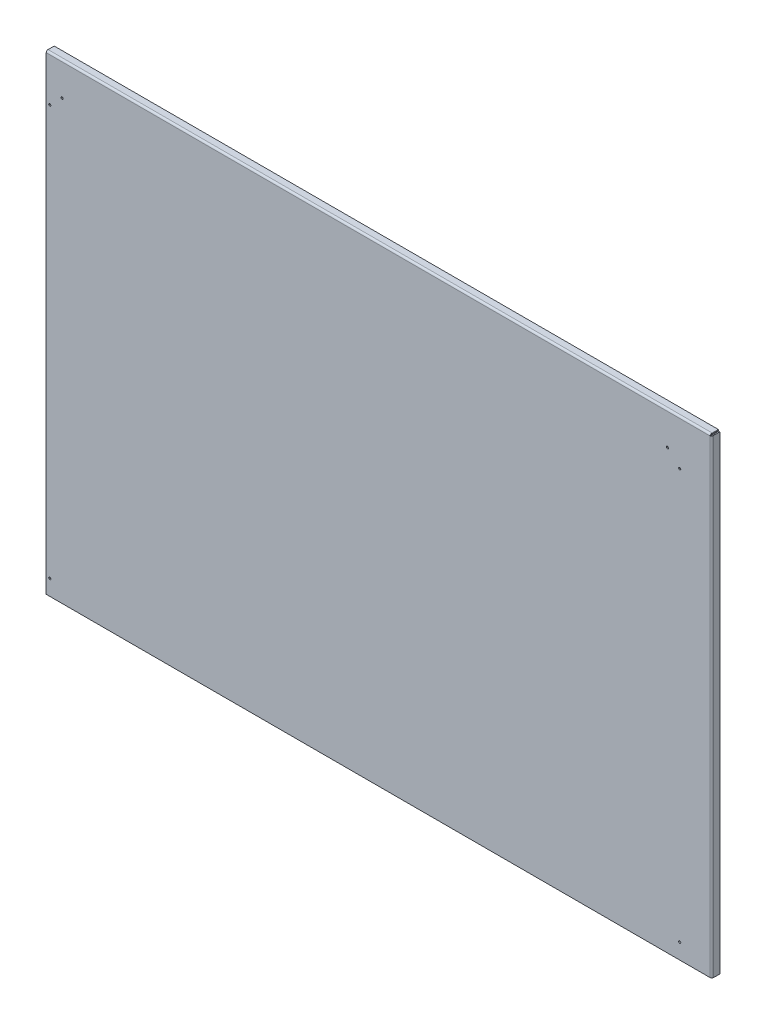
ISO-10303-21;
HEADER;
FILE_DESCRIPTION(('STEP AP214'),'2;1');
FILE_NAME('part.step','',(''),(''),'','','');
FILE_SCHEMA(('AUTOMOTIVE_DESIGN { 1 0 10303 214 1 1 1 1 }'));
ENDSEC;
DATA;
#1=APPLICATION_CONTEXT('core data for automotive mechanical design processes');
#2=APPLICATION_PROTOCOL_DEFINITION('international standard','automotive_design',2000,#1);
#3=PRODUCT_CONTEXT('',#1,'mechanical');
#4=PRODUCT('Part','Part','',(#3));
#5=PRODUCT_RELATED_PRODUCT_CATEGORY('part','',(#4));
#6=PRODUCT_DEFINITION_FORMATION('','',#4);
#7=PRODUCT_DEFINITION_CONTEXT('part definition',#1,'design');
#8=PRODUCT_DEFINITION('design','',#6,#7);
#9=PRODUCT_DEFINITION_SHAPE('','',#8);
#10=(LENGTH_UNIT() NAMED_UNIT(*) SI_UNIT(.MILLI.,.METRE.));
#11=(NAMED_UNIT(*) PLANE_ANGLE_UNIT() SI_UNIT($,.RADIAN.));
#12=(NAMED_UNIT(*) SI_UNIT($,.STERADIAN.) SOLID_ANGLE_UNIT());
#13=UNCERTAINTY_MEASURE_WITH_UNIT(LENGTH_MEASURE(1.E-05),#10,'distance_accuracy_value','');
#14=(GEOMETRIC_REPRESENTATION_CONTEXT(3) GLOBAL_UNCERTAINTY_ASSIGNED_CONTEXT((#13)) GLOBAL_UNIT_ASSIGNED_CONTEXT((#10,
#11,#12)) REPRESENTATION_CONTEXT('',''));
#15=CARTESIAN_POINT('',(0.,0.,0.));
#16=DIRECTION('',(0.,0.,1.));
#17=DIRECTION('',(1.,0.,0.));
#18=AXIS2_PLACEMENT_3D('',#15,#16,#17);
#19=CARTESIAN_POINT('',(0.,0.,-1.5));
#20=DIRECTION('',(0.,0.,-1.));
#21=DIRECTION('',(-1.,0.,0.));
#22=AXIS2_PLACEMENT_3D('',#19,#20,#21);
#23=PLANE('',#22);
#24=DIRECTION('',(0.,-1.,0.));
#25=VECTOR('',#24,1.);
#26=CARTESIAN_POINT('',(-440.1,0.,-1.5));
#27=LINE('',#26,#25);
#28=CARTESIAN_POINT('',(-440.1,322.8,-1.50000000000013));
#29=VERTEX_POINT('',#28);
#30=CARTESIAN_POINT('',(-440.1,-325.3,-1.50000000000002));
#31=VERTEX_POINT('',#30);
#32=EDGE_CURVE('E296',#29,#31,#27,.T.);
#33=ORIENTED_EDGE('',*,*,#32,.F.);
#34=DIRECTION('',(1.,0.,0.));
#35=VECTOR('',#34,1.);
#36=CARTESIAN_POINT('',(477.646446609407,322.8,-1.49999999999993));
#37=LINE('',#36,#35);
#38=CARTESIAN_POINT('',(477.,322.8,-1.5));
#39=VERTEX_POINT('',#38);
#40=EDGE_CURVE('E238',#39,#29,#37,.F.);
#41=ORIENTED_EDGE('',*,*,#40,.F.);
#42=DIRECTION('',(0.,-1.,0.));
#43=VECTOR('',#42,1.);
#44=CARTESIAN_POINT('',(477.,-325.3,-1.50000000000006));
#45=LINE('',#44,#43);
#46=CARTESIAN_POINT('',(477.,-325.3,-1.5));
#47=VERTEX_POINT('',#46);
#48=EDGE_CURVE('E384',#47,#39,#45,.F.);
#49=ORIENTED_EDGE('',*,*,#48,.F.);
#50=DIRECTION('',(1.,0.,0.));
#51=VECTOR('',#50,1.);
#52=CARTESIAN_POINT('',(479.5,-325.3,-1.5));
#53=LINE('',#52,#51);
#54=EDGE_CURVE('E13',#31,#47,#53,.T.);
#55=ORIENTED_EDGE('',*,*,#54,.F.);
#56=EDGE_LOOP('',(#33,#41,#49,#55));
#57=FACE_BOUND('',#56,.T.);
#58=CARTESIAN_POINT('',(435.15,262.7,-1.5));
#59=DIRECTION('',(0.,0.,1.));
#60=DIRECTION('',(1.,0.,0.));
#61=AXIS2_PLACEMENT_3D('',#58,#59,#60);
#62=CIRCLE('',#61,1.50000000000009);
#63=CARTESIAN_POINT('',(436.65,262.7,-1.5));
#64=VERTEX_POINT('',#63);
#65=EDGE_CURVE('E300',#64,#64,#62,.T.);
#66=ORIENTED_EDGE('',*,*,#65,.T.);
#67=EDGE_LOOP('',(#66));
#68=FACE_BOUND('',#67,.T.);
#69=CARTESIAN_POINT('',(418.1,279.45,-1.5));
#70=DIRECTION('',(0.,0.,1.));
#71=DIRECTION('',(1.,0.,0.));
#72=AXIS2_PLACEMENT_3D('',#69,#70,#71);
#73=CIRCLE('',#72,1.50000000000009);
#74=CARTESIAN_POINT('',(419.6,279.45,-1.5));
#75=VERTEX_POINT('',#74);
#76=EDGE_CURVE('E304',#75,#75,#73,.T.);
#77=ORIENTED_EDGE('',*,*,#76,.T.);
#78=EDGE_LOOP('',(#77));
#79=FACE_BOUND('',#78,.T.);
#80=CARTESIAN_POINT('',(-435.15,-303.8,-1.5));
#81=DIRECTION('',(0.,0.,1.));
#82=DIRECTION('',(-1.,0.,0.));
#83=AXIS2_PLACEMENT_3D('',#80,#81,#82);
#84=CIRCLE('',#83,1.50000000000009);
#85=CARTESIAN_POINT('',(-436.65,-303.8,-1.5));
#86=VERTEX_POINT('',#85);
#87=EDGE_CURVE('E308',#86,#86,#84,.T.);
#88=ORIENTED_EDGE('',*,*,#87,.T.);
#89=EDGE_LOOP('',(#88));
#90=FACE_BOUND('',#89,.T.);
#91=CARTESIAN_POINT('',(-435.15,262.7,-1.5));
#92=DIRECTION('',(0.,0.,1.));
#93=DIRECTION('',(-1.,0.,0.));
#94=AXIS2_PLACEMENT_3D('',#91,#92,#93);
#95=CIRCLE('',#94,1.50000000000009);
#96=CARTESIAN_POINT('',(-436.65,262.7,-1.5));
#97=VERTEX_POINT('',#96);
#98=EDGE_CURVE('E312',#97,#97,#95,.T.);
#99=ORIENTED_EDGE('',*,*,#98,.T.);
#100=EDGE_LOOP('',(#99));
#101=FACE_BOUND('',#100,.T.);
#102=CARTESIAN_POINT('',(-418.1,279.45,-1.5));
#103=DIRECTION('',(0.,0.,1.));
#104=DIRECTION('',(-1.,0.,0.));
#105=AXIS2_PLACEMENT_3D('',#102,#103,#104);
#106=CIRCLE('',#105,1.50000000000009);
#107=CARTESIAN_POINT('',(-419.6,279.45,-1.5));
#108=VERTEX_POINT('',#107);
#109=EDGE_CURVE('E316',#108,#108,#106,.T.);
#110=ORIENTED_EDGE('',*,*,#109,.T.);
#111=EDGE_LOOP('',(#110));
#112=FACE_BOUND('',#111,.T.);
#113=CARTESIAN_POINT('',(435.15,-303.8,-1.5));
#114=DIRECTION('',(0.,0.,1.));
#115=DIRECTION('',(1.,0.,0.));
#116=AXIS2_PLACEMENT_3D('',#113,#114,#115);
#117=CIRCLE('',#116,1.50000000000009);
#118=CARTESIAN_POINT('',(436.65,-303.8,-1.5));
#119=VERTEX_POINT('',#118);
#120=EDGE_CURVE('E319',#119,#119,#117,.T.);
#121=ORIENTED_EDGE('',*,*,#120,.T.);
#122=EDGE_LOOP('',(#121));
#123=FACE_BOUND('',#122,.T.);
#124=ADVANCED_FACE('F102',(#57,#68,#79,#90,#101,#112,#123),#23,.T.);
#125=CARTESIAN_POINT('',(0.,0.,0.));
#126=DIRECTION('',(0.,0.,-1.));
#127=DIRECTION('',(-1.,0.,0.));
#128=AXIS2_PLACEMENT_3D('',#125,#126,#127);
#129=PLANE('',#128);
#130=CARTESIAN_POINT('',(435.15,262.7,0.));
#131=DIRECTION('',(0.,0.,1.));
#132=DIRECTION('',(1.,0.,0.));
#133=AXIS2_PLACEMENT_3D('',#130,#131,#132);
#134=CIRCLE('',#133,1.50000000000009);
#135=CARTESIAN_POINT('',(436.65,262.7,0.));
#136=VERTEX_POINT('',#135);
#137=EDGE_CURVE('E522',#136,#136,#134,.T.);
#138=ORIENTED_EDGE('',*,*,#137,.F.);
#139=EDGE_LOOP('',(#138));
#140=FACE_BOUND('',#139,.T.);
#141=CARTESIAN_POINT('',(418.1,279.45,0.));
#142=DIRECTION('',(0.,0.,1.));
#143=DIRECTION('',(1.,0.,0.));
#144=AXIS2_PLACEMENT_3D('',#141,#142,#143);
#145=CIRCLE('',#144,1.50000000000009);
#146=CARTESIAN_POINT('',(419.6,279.45,0.));
#147=VERTEX_POINT('',#146);
#148=EDGE_CURVE('E528',#147,#147,#145,.T.);
#149=ORIENTED_EDGE('',*,*,#148,.F.);
#150=EDGE_LOOP('',(#149));
#151=FACE_BOUND('',#150,.T.);
#152=CARTESIAN_POINT('',(-435.15,-303.8,0.));
#153=DIRECTION('',(0.,0.,1.));
#154=DIRECTION('',(-1.,0.,0.));
#155=AXIS2_PLACEMENT_3D('',#152,#153,#154);
#156=CIRCLE('',#155,1.50000000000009);
#157=CARTESIAN_POINT('',(-436.65,-303.8,0.));
#158=VERTEX_POINT('',#157);
#159=EDGE_CURVE('E534',#158,#158,#156,.T.);
#160=ORIENTED_EDGE('',*,*,#159,.F.);
#161=EDGE_LOOP('',(#160));
#162=FACE_BOUND('',#161,.T.);
#163=CARTESIAN_POINT('',(-435.15,262.7,0.));
#164=DIRECTION('',(0.,0.,1.));
#165=DIRECTION('',(-1.,0.,0.));
#166=AXIS2_PLACEMENT_3D('',#163,#164,#165);
#167=CIRCLE('',#166,1.50000000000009);
#168=CARTESIAN_POINT('',(-436.65,262.7,0.));
#169=VERTEX_POINT('',#168);
#170=EDGE_CURVE('E334',#169,#169,#167,.T.);
#171=ORIENTED_EDGE('',*,*,#170,.F.);
#172=EDGE_LOOP('',(#171));
#173=FACE_BOUND('',#172,.T.);
#174=CARTESIAN_POINT('',(-418.1,279.45,0.));
#175=DIRECTION('',(0.,0.,1.));
#176=DIRECTION('',(-1.,0.,0.));
#177=AXIS2_PLACEMENT_3D('',#174,#175,#176);
#178=CIRCLE('',#177,1.50000000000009);
#179=CARTESIAN_POINT('',(-419.6,279.45,0.));
#180=VERTEX_POINT('',#179);
#181=EDGE_CURVE('E514',#180,#180,#178,.T.);
#182=ORIENTED_EDGE('',*,*,#181,.F.);
#183=EDGE_LOOP('',(#182));
#184=FACE_BOUND('',#183,.T.);
#185=CARTESIAN_POINT('',(435.15,-303.8,0.));
#186=DIRECTION('',(0.,0.,1.));
#187=DIRECTION('',(1.,0.,0.));
#188=AXIS2_PLACEMENT_3D('',#185,#186,#187);
#189=CIRCLE('',#188,1.50000000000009);
#190=CARTESIAN_POINT('',(436.65,-303.8,0.));
#191=VERTEX_POINT('',#190);
#192=EDGE_CURVE('E323',#191,#191,#189,.T.);
#193=ORIENTED_EDGE('',*,*,#192,.F.);
#194=EDGE_LOOP('',(#193));
#195=FACE_BOUND('',#194,.T.);
#196=DIRECTION('',(1.,0.,0.));
#197=VECTOR('',#196,1.);
#198=CARTESIAN_POINT('',(477.646446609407,322.8,0.));
#199=LINE('',#198,#197);
#200=CARTESIAN_POINT('',(477.,322.8,0.));
#201=VERTEX_POINT('',#200);
#202=CARTESIAN_POINT('',(-440.1,322.8,-1.30537941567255E-13));
#203=VERTEX_POINT('',#202);
#204=EDGE_CURVE('E244',#201,#203,#199,.F.);
#205=ORIENTED_EDGE('',*,*,#204,.T.);
#206=DIRECTION('',(0.,-1.,0.));
#207=VECTOR('',#206,1.);
#208=CARTESIAN_POINT('',(-440.1,0.,0.));
#209=LINE('',#208,#207);
#210=CARTESIAN_POINT('',(-440.1,-325.3,0.));
#211=VERTEX_POINT('',#210);
#212=EDGE_CURVE('E511',#203,#211,#209,.T.);
#213=ORIENTED_EDGE('',*,*,#212,.T.);
#214=DIRECTION('',(1.,0.,0.));
#215=VECTOR('',#214,1.);
#216=CARTESIAN_POINT('',(479.5,-325.3,0.));
#217=LINE('',#216,#215);
#218=CARTESIAN_POINT('',(477.,-325.3,0.));
#219=VERTEX_POINT('',#218);
#220=EDGE_CURVE('E106',#211,#219,#217,.T.);
#221=ORIENTED_EDGE('',*,*,#220,.T.);
#222=DIRECTION('',(0.,-1.,0.));
#223=VECTOR('',#222,1.);
#224=CARTESIAN_POINT('',(477.,-325.3,0.));
#225=LINE('',#224,#223);
#226=EDGE_CURVE('E379',#219,#201,#225,.F.);
#227=ORIENTED_EDGE('',*,*,#226,.T.);
#228=EDGE_LOOP('',(#205,#213,#221,#227));
#229=FACE_BOUND('',#228,.T.);
#230=ADVANCED_FACE('F288',(#140,#151,#162,#173,#184,#195,#229),#129,.F.);
#231=CARTESIAN_POINT('',(479.5,-325.3,-1.5));
#232=DIRECTION('',(0.,-1.,0.));
#233=DIRECTION('',(1.,0.,0.));
#234=AXIS2_PLACEMENT_3D('',#231,#232,#233);
#235=PLANE('',#234);
#236=DIRECTION('',(0.,0.,1.));
#237=VECTOR('',#236,1.);
#238=CARTESIAN_POINT('',(-440.1,-325.3,-11.));
#239=LINE('',#238,#237);
#240=EDGE_CURVE('E198',#31,#211,#239,.T.);
#241=ORIENTED_EDGE('',*,*,#240,.F.);
#242=ORIENTED_EDGE('',*,*,#54,.T.);
#243=DIRECTION('',(0.,0.,1.));
#244=VECTOR('',#243,1.);
#245=CARTESIAN_POINT('',(477.,-325.3,-1.50000000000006));
#246=LINE('',#245,#244);
#247=EDGE_CURVE('E237',#47,#219,#246,.T.);
#248=ORIENTED_EDGE('',*,*,#247,.T.);
#249=ORIENTED_EDGE('',*,*,#220,.F.);
#250=EDGE_LOOP('',(#241,#242,#248,#249));
#251=FACE_BOUND('',#250,.T.);
#252=ADVANCED_FACE('F104',(#251),#235,.T.);
#253=CARTESIAN_POINT('',(477.646446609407,325.315,-2.50000000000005));
#254=CARTESIAN_POINT('',(477.59256659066,325.315,-2.17072945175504));
#255=CARTESIAN_POINT('',(477.538705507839,325.249541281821,-1.84170407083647));
#256=CARTESIAN_POINT('',(477.430964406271,324.997572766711,-1.23339826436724));
#257=CARTESIAN_POINT('',(477.377093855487,324.811162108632,-0.954414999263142));
#258=CARTESIAN_POINT('',(477.26935275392,324.345585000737,-0.488837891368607));
#259=CARTESIAN_POINT('',(477.215482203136,324.066601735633,-0.302427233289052));
#260=CARTESIAN_POINT('',(477.107741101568,323.458295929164,-0.05045871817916));
#261=CARTESIAN_POINT('',(477.053880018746,323.129270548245,0.0150000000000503));
#262=CARTESIAN_POINT('',(477.,322.8,0.0150000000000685));
#263=CARTESIAN_POINT('',(477.646446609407,325.3,-2.50000000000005));
#264=CARTESIAN_POINT('',(477.592566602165,325.3,-2.17269331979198));
#265=CARTESIAN_POINT('',(477.538705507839,325.234931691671,-1.84563028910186));
#266=CARTESIAN_POINT('',(477.430964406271,324.984465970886,-1.24095254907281));
#267=CARTESIAN_POINT('',(477.377093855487,324.799167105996,-0.963633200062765));
#268=CARTESIAN_POINT('',(477.26935275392,324.336366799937,-0.500832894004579));
#269=CARTESIAN_POINT('',(477.215482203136,324.059047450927,-0.315534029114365));
#270=CARTESIAN_POINT('',(477.107741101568,323.454369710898,-0.0650683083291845));
#271=CARTESIAN_POINT('',(477.053880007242,323.127306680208,0.));
#272=CARTESIAN_POINT('',(477.,322.8,0.));
#273=CARTESIAN_POINT('',(477.646446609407,323.8,-2.49999999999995));
#274=CARTESIAN_POINT('',(477.592567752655,323.8,-2.36908012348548));
#275=CARTESIAN_POINT('',(477.538705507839,323.773972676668,-2.23825211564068));
#276=CARTESIAN_POINT('',(477.430964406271,323.673786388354,-1.99638101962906));
#277=CARTESIAN_POINT('',(477.377093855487,323.599666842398,-1.88545328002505));
#278=CARTESIAN_POINT('',(477.26935275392,323.414546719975,-1.70033315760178));
#279=CARTESIAN_POINT('',(477.215482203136,323.303618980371,-1.6262136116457));
#280=CARTESIAN_POINT('',(477.107741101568,323.061747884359,-1.52602732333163));
#281=CARTESIAN_POINT('',(477.053878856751,322.930919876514,-1.49999999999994));
#282=CARTESIAN_POINT('',(477.,322.8,-1.49999999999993));
#283=CARTESIAN_POINT('',(477.646446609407,323.78485,-2.49999999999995));
#284=CARTESIAN_POINT('',(477.592567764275,323.78485,-2.37106363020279));
#285=CARTESIAN_POINT('',(477.538705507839,323.759216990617,-2.24221759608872));
#286=CARTESIAN_POINT('',(477.430964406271,323.660548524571,-2.00401084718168));
#287=CARTESIAN_POINT('',(477.377093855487,323.587551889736,-1.89476366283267));
#288=CARTESIAN_POINT('',(477.26935275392,323.405236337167,-1.71244811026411));
#289=CARTESIAN_POINT('',(477.215482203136,323.295989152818,-1.63945147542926));
#290=CARTESIAN_POINT('',(477.107741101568,323.057782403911,-1.54078300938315));
#291=CARTESIAN_POINT('',(477.053878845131,322.928936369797,-1.51514999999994));
#292=CARTESIAN_POINT('',(477.,322.8,-1.51514999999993));
#293=B_SPLINE_SURFACE_WITH_KNOTS('',1,3,((#253,#254,#255,#256,#257,#258,#259,#260,#261,#262),
(#263,#264,#265,#266,#267,#268,#269,#270,#271,#272),(#273,#274,#275,#276,#277,#278,#279,#280,
#281,#282),(#283,#284,#285,#286,#287,#288,#289,#290,#291,#292)),.UNSPECIFIED.,.F.,.F.,.F.,(2,1,
1,2),(4,2,2,2,4),(-0.01,0.,1.,1.0101),(0.,0.25,0.5,0.75,1.),.UNSPECIFIED.);
#294=CARTESIAN_POINT('',(477.646446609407,323.8,-2.49999999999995));
#295=CARTESIAN_POINT('',(477.633912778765,323.800000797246,-2.46954646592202));
#296=CARTESIAN_POINT('',(477.62138511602,323.7986081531,-2.43910623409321));
#297=CARTESIAN_POINT('',(477.596331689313,323.793055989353,-2.37848229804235));
#298=CARTESIAN_POINT('',(477.583805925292,323.788896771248,-2.34829856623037));
#299=CARTESIAN_POINT('',(477.546253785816,323.772317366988,-2.25856742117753));
#300=CARTESIAN_POINT('',(477.521210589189,323.755795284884,-2.19973636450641));
#301=CARTESIAN_POINT('',(477.471108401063,323.712322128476,-2.08602464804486));
#302=CARTESIAN_POINT('',(477.446049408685,323.685365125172,-2.031146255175));
#303=CARTESIAN_POINT('',(477.408495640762,323.637844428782,-1.95324147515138));
#304=CARTESIAN_POINT('',(477.395982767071,323.620822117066,-1.92800732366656));
#305=CARTESIAN_POINT('',(477.37094411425,323.584535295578,-1.8791693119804));
#306=CARTESIAN_POINT('',(477.358418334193,323.565268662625,-1.85556702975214));
#307=CARTESIAN_POINT('',(477.320863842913,323.504390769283,-1.78759223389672));
#308=CARTESIAN_POINT('',(477.295818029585,323.459650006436,-1.74596758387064));
#309=CARTESIAN_POINT('',(477.24573045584,323.363350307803,-1.67154379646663));
#310=CARTESIAN_POINT('',(477.22068869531,323.31179162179,-1.63874433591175));
#311=CARTESIAN_POINT('',(477.18312921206,323.230650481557,-1.59696588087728));
#312=CARTESIAN_POINT('',(477.17059662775,323.202938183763,-1.58426700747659));
#313=CARTESIAN_POINT('',(477.145543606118,323.146499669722,-1.56145607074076));
#314=CARTESIAN_POINT('',(477.133023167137,323.117774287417,-1.55134193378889));
#315=CARTESIAN_POINT('',(477.095487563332,323.030446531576,-1.52502565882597));
#316=CARTESIAN_POINT('',(477.070445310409,322.970576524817,-1.51279007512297));
#317=CARTESIAN_POINT('',(477.03786359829,322.891889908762,-1.50405884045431));
#318=CARTESIAN_POINT('',(477.030284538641,322.873530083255,-1.50253616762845));
#319=CARTESIAN_POINT('',(477.015138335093,322.836783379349,-1.50050841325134));
#320=CARTESIAN_POINT('',(477.007571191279,322.818396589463,-1.50000172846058));
#321=CARTESIAN_POINT('',(477.,322.8,-1.49999999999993));
#322=B_SPLINE_CURVE_WITH_KNOTS('',3,(#294,#295,#296,#297,#298,#299,#300,#301,#302,#303,#304,
#305,#306,#307,#308,#309,#310,#311,#312,#313,#314,#315,#316,#317,#318,#319,#320,#321),
.UNSPECIFIED.,.F.,.F.,(4,2,2,2,2,2,2,2,2,2,2,2,2,4),(0.,0.0987374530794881,0.197464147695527,
0.394586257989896,0.59182053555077,0.690449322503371,0.789172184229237,0.986302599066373,
1.18342579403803,1.28219700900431,1.38088873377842,1.57785507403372,1.63760272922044,
1.69725602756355),.UNSPECIFIED.);
#323=CARTESIAN_POINT('',(477.646446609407,323.8,-2.49999999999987));
#324=VERTEX_POINT('',#323);
#325=EDGE_CURVE('E243',#324,#39,#322,.T.);
#326=DIRECTION('',(0.,1.,0.));
#327=VECTOR('',#326,1.);
#328=CARTESIAN_POINT('',(477.646446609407,323.8,-2.49999999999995));
#329=LINE('',#328,#327);
#330=CARTESIAN_POINT('',(477.646446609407,325.3,-2.49999999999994));
#331=VERTEX_POINT('',#330);
#332=EDGE_CURVE('E221',#331,#324,#329,.F.);
#333=CARTESIAN_POINT('',(477.646446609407,325.3,-2.50000000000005));
#334=CARTESIAN_POINT('',(477.636051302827,325.300000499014,-2.43685419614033));
#335=CARTESIAN_POINT('',(477.625659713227,325.297606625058,-2.373730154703));
#336=CARTESIAN_POINT('',(477.60487810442,325.288052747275,-2.24785126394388));
#337=CARTESIAN_POINT('',(477.594488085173,325.280893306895,-2.18509637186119));
#338=CARTESIAN_POINT('',(477.563317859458,325.252308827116,-1.99791113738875));
#339=CARTESIAN_POINT('',(477.542527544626,325.223777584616,-1.87449916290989));
#340=CARTESIAN_POINT('',(477.498282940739,325.143572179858,-1.61797358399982));
#341=CARTESIAN_POINT('',(477.474828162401,325.089403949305,-1.48563908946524));
#342=CARTESIAN_POINT('',(477.427921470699,324.959341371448,-1.23211090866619));
#343=CARTESIAN_POINT('',(477.404469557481,324.883446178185,-1.11091765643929));
#344=CARTESIAN_POINT('',(477.357564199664,324.712148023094,-0.883216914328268));
#345=CARTESIAN_POINT('',(477.334110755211,324.616746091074,-0.77670864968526));
#346=CARTESIAN_POINT('',(477.287202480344,324.409198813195,-0.581464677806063));
#347=CARTESIAN_POINT('',(477.263747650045,324.297051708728,-0.492730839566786));
#348=CARTESIAN_POINT('',(477.216835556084,324.059286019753,-0.335626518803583));
#349=CARTESIAN_POINT('',(477.193378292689,323.933665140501,-0.267259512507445));
#350=CARTESIAN_POINT('',(477.146466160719,323.672637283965,-0.15292055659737));
#351=CARTESIAN_POINT('',(477.123011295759,323.537234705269,-0.106938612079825));
#352=CARTESIAN_POINT('',(477.082961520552,323.301027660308,-0.0486401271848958));
#353=CARTESIAN_POINT('',(477.066359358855,323.201639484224,-0.030417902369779));
#354=CARTESIAN_POINT('',(477.033174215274,323.00151405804,-0.0060948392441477));
#355=CARTESIAN_POINT('',(477.016591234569,322.900778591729,2.06840414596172E-05));
#356=CARTESIAN_POINT('',(477.,322.8,0.));
#357=B_SPLINE_CURVE_WITH_KNOTS('',3,(#333,#334,#335,#336,#337,#338,#339,#340,#341,#342,#343,
#344,#345,#346,#347,#348,#349,#350,#351,#352,#353,#354,#355,#356),.UNSPECIFIED.,.F.,.F.,(4,2,2,
2,2,2,2,2,2,2,2,4),(0.,0.191898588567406,0.38377449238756,0.767342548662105,1.19998868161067,
1.63265166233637,2.06529180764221,2.49797742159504,2.93073684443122,3.36330286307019,
3.6698131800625,3.97595148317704),.UNSPECIFIED.);
#358=EDGE_CURVE('E242',#331,#201,#357,.T.);
#359=DIRECTION('',(0.,0.,1.));
#360=VECTOR('',#359,1.);
#361=CARTESIAN_POINT('',(477.,322.8,-1.49999999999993));
#362=LINE('',#361,#360);
#363=EDGE_CURVE('E248',#39,#201,#362,.T.);
#364=ORIENTED_EDGE('',*,*,#325,.F.);
#365=ORIENTED_EDGE('',*,*,#332,.F.);
#366=ORIENTED_EDGE('',*,*,#358,.T.);
#367=ORIENTED_EDGE('',*,*,#363,.F.);
#368=EDGE_LOOP('',(#364,#365,#366,#367));
#369=FACE_BOUND('',#368,.T.);
#370=ADVANCED_FACE('F266',(#369),#293,.F.);
#371=CARTESIAN_POINT('',(477.646446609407,322.8,-2.49999999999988));
#372=DIRECTION('',(1.,0.,0.));
#373=DIRECTION('',(0.,1.,0.));
#374=AXIS2_PLACEMENT_3D('',#371,#372,#373);
#375=CYLINDRICAL_SURFACE('',#374,2.49999999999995);
#376=CARTESIAN_POINT('',(-440.1,322.8,-2.50000000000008));
#377=DIRECTION('',(1.,0.,0.));
#378=DIRECTION('',(0.,1.,0.));
#379=AXIS2_PLACEMENT_3D('',#376,#377,#378);
#380=CIRCLE('',#379,2.49999999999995);
#381=CARTESIAN_POINT('',(-440.1,325.3,-2.49999999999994));
#382=VERTEX_POINT('',#381);
#383=EDGE_CURVE('E490',#203,#382,#380,.F.);
#384=ORIENTED_EDGE('',*,*,#383,.F.);
#385=ORIENTED_EDGE('',*,*,#204,.F.);
#386=ORIENTED_EDGE('',*,*,#358,.F.);
#387=DIRECTION('',(1.,0.,0.));
#388=VECTOR('',#387,1.);
#389=CARTESIAN_POINT('',(0.,325.3,-2.49999999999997));
#390=LINE('',#389,#388);
#391=EDGE_CURVE('E216',#382,#331,#390,.T.);
#392=ORIENTED_EDGE('',*,*,#391,.F.);
#393=EDGE_LOOP('',(#384,#385,#386,#392));
#394=FACE_BOUND('',#393,.T.);
#395=ADVANCED_FACE('F271',(#394),#375,.T.);
#396=CARTESIAN_POINT('',(477.646446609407,322.8,-2.49999999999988));
#397=DIRECTION('',(1.,0.,0.));
#398=DIRECTION('',(0.,1.,0.));
#399=AXIS2_PLACEMENT_3D('',#396,#397,#398);
#400=CYLINDRICAL_SURFACE('',#399,0.999999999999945);
#401=ORIENTED_EDGE('',*,*,#40,.T.);
#402=CARTESIAN_POINT('',(-440.1,322.8,-2.50000000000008));
#403=DIRECTION('',(1.,0.,0.));
#404=DIRECTION('',(0.,1.,0.));
#405=AXIS2_PLACEMENT_3D('',#402,#403,#404);
#406=CIRCLE('',#405,0.999999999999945);
#407=CARTESIAN_POINT('',(-440.1,323.8,-2.49999999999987));
#408=VERTEX_POINT('',#407);
#409=EDGE_CURVE('E208',#29,#408,#406,.F.);
#410=ORIENTED_EDGE('',*,*,#409,.T.);
#411=DIRECTION('',(-1.,0.,0.));
#412=VECTOR('',#411,1.);
#413=CARTESIAN_POINT('',(-479.5,323.8,-2.5));
#414=LINE('',#413,#412);
#415=EDGE_CURVE('E206',#408,#324,#414,.F.);
#416=ORIENTED_EDGE('',*,*,#415,.T.);
#417=ORIENTED_EDGE('',*,*,#325,.T.);
#418=EDGE_LOOP('',(#401,#410,#416,#417));
#419=FACE_BOUND('',#418,.T.);
#420=ADVANCED_FACE('F275',(#419),#400,.F.);
#421=CARTESIAN_POINT('',(0.,325.3,1.90605590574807E-12));
#422=DIRECTION('',(0.,1.,0.));
#423=DIRECTION('',(0.,0.,1.));
#424=AXIS2_PLACEMENT_3D('',#421,#422,#423);
#425=PLANE('',#424);
#426=DIRECTION('',(0.,0.,1.));
#427=VECTOR('',#426,1.);
#428=CARTESIAN_POINT('',(-440.1,325.3,-11.));
#429=LINE('',#428,#427);
#430=CARTESIAN_POINT('',(-440.1,325.3,-11.));
#431=VERTEX_POINT('',#430);
#432=EDGE_CURVE('E118',#431,#382,#429,.T.);
#433=ORIENTED_EDGE('',*,*,#432,.T.);
#434=ORIENTED_EDGE('',*,*,#391,.T.);
#435=DIRECTION('',(0.,0.,-1.));
#436=VECTOR('',#435,1.);
#437=CARTESIAN_POINT('',(477.646446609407,325.3,-1.49999999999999));
#438=LINE('',#437,#436);
#439=CARTESIAN_POINT('',(477.646446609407,325.3,-11.));
#440=VERTEX_POINT('',#439);
#441=EDGE_CURVE('E230',#440,#331,#438,.F.);
#442=ORIENTED_EDGE('',*,*,#441,.F.);
#443=DIRECTION('',(1.,0.,0.));
#444=VECTOR('',#443,1.);
#445=CARTESIAN_POINT('',(479.5,325.3,-11.));
#446=LINE('',#445,#444);
#447=EDGE_CURVE('E215',#431,#440,#446,.T.);
#448=ORIENTED_EDGE('',*,*,#447,.F.);
#449=EDGE_LOOP('',(#433,#434,#442,#448));
#450=FACE_BOUND('',#449,.T.);
#451=ADVANCED_FACE('F280',(#450),#425,.T.);
#452=CARTESIAN_POINT('',(0.,323.8,1.90081868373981E-12));
#453=DIRECTION('',(0.,1.,0.));
#454=DIRECTION('',(0.,0.,1.));
#455=AXIS2_PLACEMENT_3D('',#452,#453,#454);
#456=PLANE('',#455);
#457=ORIENTED_EDGE('',*,*,#415,.F.);
#458=DIRECTION('',(0.,0.,-1.));
#459=VECTOR('',#458,1.);
#460=CARTESIAN_POINT('',(-440.1,323.8,1.90081868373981E-12));
#461=LINE('',#460,#459);
#462=CARTESIAN_POINT('',(-440.1,323.8,-11.));
#463=VERTEX_POINT('',#462);
#464=EDGE_CURVE('E192',#408,#463,#461,.T.);
#465=ORIENTED_EDGE('',*,*,#464,.T.);
#466=DIRECTION('',(-1.,0.,0.));
#467=VECTOR('',#466,1.);
#468=CARTESIAN_POINT('',(0.,323.8,-11.));
#469=LINE('',#468,#467);
#470=CARTESIAN_POINT('',(477.646446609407,323.8,-11.));
#471=VERTEX_POINT('',#470);
#472=EDGE_CURVE('E204',#463,#471,#469,.F.);
#473=ORIENTED_EDGE('',*,*,#472,.T.);
#474=DIRECTION('',(0.,0.,-1.));
#475=VECTOR('',#474,1.);
#476=CARTESIAN_POINT('',(477.646446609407,323.8,-1.5));
#477=LINE('',#476,#475);
#478=EDGE_CURVE('E234',#324,#471,#477,.T.);
#479=ORIENTED_EDGE('',*,*,#478,.F.);
#480=EDGE_LOOP('',(#457,#465,#473,#479));
#481=FACE_BOUND('',#480,.T.);
#482=ADVANCED_FACE('F202',(#481),#456,.F.);
#483=CARTESIAN_POINT('',(479.5,325.3,-11.));
#484=DIRECTION('',(0.,0.,-1.));
#485=DIRECTION('',(0.,1.,0.));
#486=AXIS2_PLACEMENT_3D('',#483,#484,#485);
#487=PLANE('',#486);
#488=DIRECTION('',(0.,1.,0.));
#489=VECTOR('',#488,1.);
#490=CARTESIAN_POINT('',(-440.1,325.3,-11.));
#491=LINE('',#490,#489);
#492=EDGE_CURVE('E189',#463,#431,#491,.T.);
#493=ORIENTED_EDGE('',*,*,#492,.T.);
#494=ORIENTED_EDGE('',*,*,#447,.T.);
#495=DIRECTION('',(0.,-1.,0.));
#496=VECTOR('',#495,1.);
#497=CARTESIAN_POINT('',(477.646446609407,323.8,-11.));
#498=LINE('',#497,#496);
#499=EDGE_CURVE('E212',#471,#440,#498,.F.);
#500=ORIENTED_EDGE('',*,*,#499,.F.);
#501=ORIENTED_EDGE('',*,*,#472,.F.);
#502=EDGE_LOOP('',(#493,#494,#500,#501));
#503=FACE_BOUND('',#502,.T.);
#504=ADVANCED_FACE('F210',(#503),#487,.T.);
#505=CARTESIAN_POINT('',(477.646446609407,323.8,-1.5));
#506=DIRECTION('',(-1.,0.,0.));
#507=DIRECTION('',(0.,0.,1.));
#508=AXIS2_PLACEMENT_3D('',#505,#506,#507);
#509=PLANE('',#508);
#510=ORIENTED_EDGE('',*,*,#478,.T.);
#511=ORIENTED_EDGE('',*,*,#499,.T.);
#512=ORIENTED_EDGE('',*,*,#441,.T.);
#513=ORIENTED_EDGE('',*,*,#332,.T.);
#514=EDGE_LOOP('',(#510,#511,#512,#513));
#515=FACE_BOUND('',#514,.T.);
#516=ADVANCED_FACE('F498',(#515),#509,.F.);
#517=CARTESIAN_POINT('',(477.,322.8,0.0149999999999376));
#518=CARTESIAN_POINT('',(477.329270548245,322.853880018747,0.0149999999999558));
#519=CARTESIAN_POINT('',(477.658295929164,322.907741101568,-0.0504587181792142));
#520=CARTESIAN_POINT('',(478.266601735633,323.015482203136,-0.302427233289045));
#521=CARTESIAN_POINT('',(478.545585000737,323.06935275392,-0.488837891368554));
#522=CARTESIAN_POINT('',(479.011162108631,323.177093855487,-0.954414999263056));
#523=CARTESIAN_POINT('',(479.197572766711,323.230964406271,-1.23339826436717));
#524=CARTESIAN_POINT('',(479.449541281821,323.338705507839,-1.84170407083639));
#525=CARTESIAN_POINT('',(479.515,323.39256659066,-2.17072945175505));
#526=CARTESIAN_POINT('',(479.515,323.446446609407,-2.49999999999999));
#527=CARTESIAN_POINT('',(477.,322.8,0.));
#528=CARTESIAN_POINT('',(477.327306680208,322.853880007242,0.));
#529=CARTESIAN_POINT('',(477.654369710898,322.907741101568,-0.0650683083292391));
#530=CARTESIAN_POINT('',(478.259047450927,323.015482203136,-0.315534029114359));
#531=CARTESIAN_POINT('',(478.536366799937,323.06935275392,-0.500832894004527));
#532=CARTESIAN_POINT('',(478.999167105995,323.177093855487,-0.963633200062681));
#533=CARTESIAN_POINT('',(479.184465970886,323.230964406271,-1.24095254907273));
#534=CARTESIAN_POINT('',(479.434931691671,323.338705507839,-1.84563028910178));
#535=CARTESIAN_POINT('',(479.5,323.392566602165,-2.17269331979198));
#536=CARTESIAN_POINT('',(479.5,323.446446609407,-2.49999999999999));
#537=CARTESIAN_POINT('',(477.,322.8,-1.50000000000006));
#538=CARTESIAN_POINT('',(477.130919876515,322.853878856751,-1.50000000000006));
#539=CARTESIAN_POINT('',(477.261747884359,322.907741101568,-1.52602732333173));
#540=CARTESIAN_POINT('',(477.503618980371,323.015482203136,-1.62621361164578));
#541=CARTESIAN_POINT('',(477.614546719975,323.06935275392,-1.70033315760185));
#542=CARTESIAN_POINT('',(477.799666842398,323.177093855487,-1.8854532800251));
#543=CARTESIAN_POINT('',(477.873786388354,323.230964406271,-1.99638101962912));
#544=CARTESIAN_POINT('',(477.973972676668,323.338705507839,-2.23825211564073));
#545=CARTESIAN_POINT('',(478.,323.392567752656,-2.3690801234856));
#546=CARTESIAN_POINT('',(478.,323.446446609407,-2.5));
#547=CARTESIAN_POINT('',(477.,322.8,-1.51515000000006));
#548=CARTESIAN_POINT('',(477.128936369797,322.853878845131,-1.51515000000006));
#549=CARTESIAN_POINT('',(477.257782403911,322.907741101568,-1.54078300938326));
#550=CARTESIAN_POINT('',(477.495989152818,323.015482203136,-1.63945147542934));
#551=CARTESIAN_POINT('',(477.605236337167,323.06935275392,-1.71244811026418));
#552=CARTESIAN_POINT('',(477.787551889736,323.177093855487,-1.89476366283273));
#553=CARTESIAN_POINT('',(477.860548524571,323.230964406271,-2.00401084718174));
#554=CARTESIAN_POINT('',(477.959216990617,323.338705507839,-2.24221759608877));
#555=CARTESIAN_POINT('',(477.98485,323.392567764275,-2.3710636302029));
#556=CARTESIAN_POINT('',(477.98485,323.446446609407,-2.5));
#557=B_SPLINE_SURFACE_WITH_KNOTS('',1,3,((#517,#518,#519,#520,#521,#522,#523,#524,#525,#526),
(#527,#528,#529,#530,#531,#532,#533,#534,#535,#536),(#537,#538,#539,#540,#541,#542,#543,#544,
#545,#546),(#547,#548,#549,#550,#551,#552,#553,#554,#555,#556)),.UNSPECIFIED.,.F.,.F.,.F.,(2,1,
1,2),(4,2,2,2,4),(-0.01,0.,1.,1.0101),(0.,0.25,0.5,0.75,1.),.UNSPECIFIED.);
#558=DIRECTION('',(-1.,0.,0.));
#559=VECTOR('',#558,1.);
#560=CARTESIAN_POINT('',(478.,323.446446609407,-2.5));
#561=LINE('',#560,#559);
#562=CARTESIAN_POINT('',(479.5,323.446446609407,-2.49999999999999));
#563=VERTEX_POINT('',#562);
#564=CARTESIAN_POINT('',(478.,323.446446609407,-2.5));
#565=VERTEX_POINT('',#564);
#566=EDGE_CURVE('E337',#563,#565,#561,.T.);
#567=CARTESIAN_POINT('',(477.,322.8,-1.50000000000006));
#568=CARTESIAN_POINT('',(477.030453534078,322.812533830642,-1.49999920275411));
#569=CARTESIAN_POINT('',(477.060893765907,322.825061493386,-1.50139184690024));
#570=CARTESIAN_POINT('',(477.121517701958,322.850114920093,-1.50694401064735));
#571=CARTESIAN_POINT('',(477.15170143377,322.862640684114,-1.5111032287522));
#572=CARTESIAN_POINT('',(477.241432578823,322.90019282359,-1.52768263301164));
#573=CARTESIAN_POINT('',(477.300263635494,322.925236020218,-1.54420471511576));
#574=CARTESIAN_POINT('',(477.413975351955,322.975338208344,-1.58767787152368));
#575=CARTESIAN_POINT('',(477.468853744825,323.000397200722,-1.61463487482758));
#576=CARTESIAN_POINT('',(477.546758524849,323.037950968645,-1.66215557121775));
#577=CARTESIAN_POINT('',(477.571992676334,323.050463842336,-1.67917788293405));
#578=CARTESIAN_POINT('',(477.62083068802,323.075502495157,-1.71546470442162));
#579=CARTESIAN_POINT('',(477.644432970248,323.088028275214,-1.73473133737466));
#580=CARTESIAN_POINT('',(477.712407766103,323.125582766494,-1.79560923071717));
#581=CARTESIAN_POINT('',(477.754032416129,323.150628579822,-1.84034999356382));
#582=CARTESIAN_POINT('',(477.828456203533,323.200716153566,-1.93664969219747));
#583=CARTESIAN_POINT('',(477.861255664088,323.225757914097,-1.98820837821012));
#584=CARTESIAN_POINT('',(477.903034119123,323.263317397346,-2.06934951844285));
#585=CARTESIAN_POINT('',(477.915732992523,323.275849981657,-2.09706181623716));
#586=CARTESIAN_POINT('',(477.938543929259,323.300903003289,-2.15350033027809));
#587=CARTESIAN_POINT('',(477.948658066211,323.313423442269,-2.18222571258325));
#588=CARTESIAN_POINT('',(477.974974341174,323.350959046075,-2.26955346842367));
#589=CARTESIAN_POINT('',(477.987209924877,323.376001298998,-2.32942347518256));
#590=CARTESIAN_POINT('',(477.995941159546,323.408583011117,-2.40811009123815));
#591=CARTESIAN_POINT('',(477.997463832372,323.416162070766,-2.42646991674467));
#592=CARTESIAN_POINT('',(477.999491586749,323.431308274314,-2.46321662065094));
#593=CARTESIAN_POINT('',(477.999998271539,323.438875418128,-2.48160341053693));
#594=CARTESIAN_POINT('',(478.,323.446446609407,-2.5));
#595=B_SPLINE_CURVE_WITH_KNOTS('',3,(#567,#568,#569,#570,#571,#572,#573,#574,#575,#576,#577,
#578,#579,#580,#581,#582,#583,#584,#585,#586,#587,#588,#589,#590,#591,#592,#593,#594),
.UNSPECIFIED.,.F.,.F.,(4,2,2,2,2,2,2,2,2,2,2,2,2,4),(0.,0.098737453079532,0.197464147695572,
0.394586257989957,0.591820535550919,0.690449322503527,0.789172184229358,0.986302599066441,
1.18342579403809,1.28219700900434,1.38088873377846,1.57785507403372,1.63760272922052,
1.69725602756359),.UNSPECIFIED.);
#596=EDGE_CURVE('E380',#39,#565,#595,.T.);
#597=CARTESIAN_POINT('',(477.,322.8,0.));
#598=CARTESIAN_POINT('',(477.06314580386,322.81039530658,4.99013874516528E-07));
#599=CARTESIAN_POINT('',(477.126269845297,322.82078689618,-0.00239337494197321));
#600=CARTESIAN_POINT('',(477.252148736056,322.841568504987,-0.0119472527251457));
#601=CARTESIAN_POINT('',(477.314903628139,322.851958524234,-0.019106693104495));
#602=CARTESIAN_POINT('',(477.502088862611,322.883128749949,-0.0476911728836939));
#603=CARTESIAN_POINT('',(477.62550083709,322.903919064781,-0.0762224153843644));
#604=CARTESIAN_POINT('',(477.882026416,322.948163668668,-0.156427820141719));
#605=CARTESIAN_POINT('',(478.014360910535,322.971618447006,-0.210596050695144));
#606=CARTESIAN_POINT('',(478.267889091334,323.018525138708,-0.340658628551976));
#607=CARTESIAN_POINT('',(478.389082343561,323.041977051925,-0.416553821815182));
#608=CARTESIAN_POINT('',(478.616783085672,323.088882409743,-0.587851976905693));
#609=CARTESIAN_POINT('',(478.723291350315,323.112335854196,-0.683253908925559));
#610=CARTESIAN_POINT('',(478.918535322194,323.159244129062,-0.890801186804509));
#611=CARTESIAN_POINT('',(479.007269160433,323.182698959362,-1.00294829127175));
#612=CARTESIAN_POINT('',(479.164373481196,323.229611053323,-1.2407139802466));
#613=CARTESIAN_POINT('',(479.232740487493,323.253068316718,-1.36633485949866));
#614=CARTESIAN_POINT('',(479.347079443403,323.299980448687,-1.6273627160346));
#615=CARTESIAN_POINT('',(479.39306138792,323.323435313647,-1.76276529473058));
#616=CARTESIAN_POINT('',(479.451359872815,323.363485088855,-1.99897233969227));
#617=CARTESIAN_POINT('',(479.46958209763,323.380087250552,-2.09836051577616));
#618=CARTESIAN_POINT('',(479.493905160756,323.413272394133,-2.29848594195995));
#619=CARTESIAN_POINT('',(479.500020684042,323.429855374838,-2.39922140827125));
#620=CARTESIAN_POINT('',(479.5,323.446446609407,-2.49999999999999));
#621=B_SPLINE_CURVE_WITH_KNOTS('',3,(#597,#598,#599,#600,#601,#602,#603,#604,#605,#606,#607,
#608,#609,#610,#611,#612,#613,#614,#615,#616,#617,#618,#619,#620),.UNSPECIFIED.,.F.,.F.,(4,2,2,
2,2,2,2,2,2,2,2,4),(0.,0.191898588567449,0.383774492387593,0.767342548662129,1.19998868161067,
1.63265166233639,2.06529180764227,2.49797742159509,2.93073684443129,3.36330286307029,
3.66981318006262,3.97595148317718),.UNSPECIFIED.);
#622=EDGE_CURVE('E390',#201,#563,#621,.T.);
#623=ORIENTED_EDGE('',*,*,#566,.T.);
#624=ORIENTED_EDGE('',*,*,#596,.F.);
#625=ORIENTED_EDGE('',*,*,#363,.T.);
#626=ORIENTED_EDGE('',*,*,#622,.T.);
#627=EDGE_LOOP('',(#623,#624,#625,#626));
#628=FACE_BOUND('',#627,.T.);
#629=ADVANCED_FACE('F407',(#628),#557,.F.);
#630=CARTESIAN_POINT('',(477.,-325.3,-2.50000000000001));
#631=DIRECTION('',(0.,1.,0.));
#632=DIRECTION('',(0.,0.,1.));
#633=AXIS2_PLACEMENT_3D('',#630,#631,#632);
#634=PLANE('',#633);
#635=CARTESIAN_POINT('',(477.,-325.3,-2.50000000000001));
#636=DIRECTION('',(0.,-1.,0.));
#637=DIRECTION('',(0.,0.,-1.));
#638=AXIS2_PLACEMENT_3D('',#635,#636,#637);
#639=CIRCLE('',#638,0.999999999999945);
#640=CARTESIAN_POINT('',(478.,-325.3,-2.5));
#641=VERTEX_POINT('',#640);
#642=EDGE_CURVE('E340',#641,#47,#639,.T.);
#643=ORIENTED_EDGE('',*,*,#642,.F.);
#644=DIRECTION('',(1.,0.,0.));
#645=VECTOR('',#644,1.);
#646=CARTESIAN_POINT('',(478.,-325.3,-2.5));
#647=LINE('',#646,#645);
#648=CARTESIAN_POINT('',(479.5,-325.3,-2.49999999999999));
#649=VERTEX_POINT('',#648);
#650=EDGE_CURVE('E362',#641,#649,#647,.T.);
#651=ORIENTED_EDGE('',*,*,#650,.T.);
#652=CARTESIAN_POINT('',(477.,-325.3,-2.50000000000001));
#653=DIRECTION('',(0.,-1.,0.));
#654=DIRECTION('',(0.,0.,-1.));
#655=AXIS2_PLACEMENT_3D('',#652,#653,#654);
#656=CIRCLE('',#655,2.49999999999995);
#657=EDGE_CURVE('E375',#649,#219,#656,.T.);
#658=ORIENTED_EDGE('',*,*,#657,.T.);
#659=ORIENTED_EDGE('',*,*,#247,.F.);
#660=EDGE_LOOP('',(#643,#651,#658,#659));
#661=FACE_BOUND('',#660,.T.);
#662=ADVANCED_FACE('F417',(#661),#634,.F.);
#663=CARTESIAN_POINT('',(477.,-325.3,-2.50000000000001));
#664=DIRECTION('',(0.,-1.,0.));
#665=DIRECTION('',(1.,0.,0.));
#666=AXIS2_PLACEMENT_3D('',#663,#664,#665);
#667=CYLINDRICAL_SURFACE('',#666,2.49999999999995);
#668=ORIENTED_EDGE('',*,*,#226,.F.);
#669=ORIENTED_EDGE('',*,*,#657,.F.);
#670=DIRECTION('',(0.,-1.,0.));
#671=VECTOR('',#670,1.);
#672=CARTESIAN_POINT('',(479.5,325.3,-2.49999999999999));
#673=LINE('',#672,#671);
#674=EDGE_CURVE('E359',#649,#563,#673,.F.);
#675=ORIENTED_EDGE('',*,*,#674,.T.);
#676=ORIENTED_EDGE('',*,*,#622,.F.);
#677=EDGE_LOOP('',(#668,#669,#675,#676));
#678=FACE_BOUND('',#677,.T.);
#679=ADVANCED_FACE('F412',(#678),#667,.T.);
#680=CARTESIAN_POINT('',(477.,-325.3,-2.50000000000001));
#681=DIRECTION('',(0.,-1.,0.));
#682=DIRECTION('',(1.,0.,0.));
#683=AXIS2_PLACEMENT_3D('',#680,#681,#682);
#684=CYLINDRICAL_SURFACE('',#683,0.999999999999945);
#685=ORIENTED_EDGE('',*,*,#48,.T.);
#686=ORIENTED_EDGE('',*,*,#596,.T.);
#687=DIRECTION('',(0.,-1.,0.));
#688=VECTOR('',#687,1.);
#689=CARTESIAN_POINT('',(478.,325.3,-2.5));
#690=LINE('',#689,#688);
#691=EDGE_CURVE('E366',#565,#641,#690,.T.);
#692=ORIENTED_EDGE('',*,*,#691,.T.);
#693=ORIENTED_EDGE('',*,*,#642,.T.);
#694=EDGE_LOOP('',(#685,#686,#692,#693));
#695=FACE_BOUND('',#694,.T.);
#696=ADVANCED_FACE('F416',(#695),#684,.F.);
#697=CARTESIAN_POINT('',(478.,323.446446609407,-1.5));
#698=DIRECTION('',(0.,1.,0.));
#699=DIRECTION('',(0.,0.,1.));
#700=AXIS2_PLACEMENT_3D('',#697,#698,#699);
#701=PLANE('',#700);
#702=DIRECTION('',(1.,0.,0.));
#703=VECTOR('',#702,1.);
#704=CARTESIAN_POINT('',(479.5,323.446446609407,-11.));
#705=LINE('',#704,#703);
#706=CARTESIAN_POINT('',(478.,323.446446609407,-11.));
#707=VERTEX_POINT('',#706);
#708=CARTESIAN_POINT('',(479.5,323.446446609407,-11.));
#709=VERTEX_POINT('',#708);
#710=EDGE_CURVE('E369',#707,#709,#705,.T.);
#711=ORIENTED_EDGE('',*,*,#710,.F.);
#712=DIRECTION('',(0.,0.,-1.));
#713=VECTOR('',#712,1.);
#714=CARTESIAN_POINT('',(478.,323.446446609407,5.06046678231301E-12));
#715=LINE('',#714,#713);
#716=EDGE_CURVE('E322',#565,#707,#715,.T.);
#717=ORIENTED_EDGE('',*,*,#716,.F.);
#718=ORIENTED_EDGE('',*,*,#566,.F.);
#719=DIRECTION('',(0.,0.,1.));
#720=VECTOR('',#719,1.);
#721=CARTESIAN_POINT('',(479.5,323.446446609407,-1.49999999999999));
#722=LINE('',#721,#720);
#723=EDGE_CURVE('E329',#563,#709,#722,.F.);
#724=ORIENTED_EDGE('',*,*,#723,.T.);
#725=EDGE_LOOP('',(#711,#717,#718,#724));
#726=FACE_BOUND('',#725,.T.);
#727=ADVANCED_FACE('F423',(#726),#701,.T.);
#728=CARTESIAN_POINT('',(479.5,0.,2.80708953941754E-12));
#729=DIRECTION('',(-1.,0.,0.));
#730=DIRECTION('',(0.,0.,1.));
#731=AXIS2_PLACEMENT_3D('',#728,#729,#730);
#732=PLANE('',#731);
#733=ORIENTED_EDGE('',*,*,#723,.F.);
#734=ORIENTED_EDGE('',*,*,#674,.F.);
#735=DIRECTION('',(0.,0.,-1.));
#736=VECTOR('',#735,1.);
#737=CARTESIAN_POINT('',(479.5,-325.3,-10.9999999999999));
#738=LINE('',#737,#736);
#739=CARTESIAN_POINT('',(479.5,-325.3,-10.9999999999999));
#740=VERTEX_POINT('',#739);
#741=EDGE_CURVE('E345',#740,#649,#738,.F.);
#742=ORIENTED_EDGE('',*,*,#741,.F.);
#743=DIRECTION('',(0.,1.,0.));
#744=VECTOR('',#743,1.);
#745=CARTESIAN_POINT('',(479.5,325.3,-11.));
#746=LINE('',#745,#744);
#747=EDGE_CURVE('E349',#709,#740,#746,.F.);
#748=ORIENTED_EDGE('',*,*,#747,.F.);
#749=EDGE_LOOP('',(#733,#734,#742,#748));
#750=FACE_BOUND('',#749,.T.);
#751=ADVANCED_FACE('F428',(#750),#732,.F.);
#752=CARTESIAN_POINT('',(478.,0.,2.80185231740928E-12));
#753=DIRECTION('',(-1.,0.,0.));
#754=DIRECTION('',(0.,0.,1.));
#755=AXIS2_PLACEMENT_3D('',#752,#753,#754);
#756=PLANE('',#755);
#757=ORIENTED_EDGE('',*,*,#691,.F.);
#758=ORIENTED_EDGE('',*,*,#716,.T.);
#759=DIRECTION('',(0.,-1.,0.));
#760=VECTOR('',#759,1.);
#761=CARTESIAN_POINT('',(478.,0.,-11.));
#762=LINE('',#761,#760);
#763=CARTESIAN_POINT('',(478.,-325.3,-10.9999999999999));
#764=VERTEX_POINT('',#763);
#765=EDGE_CURVE('E356',#707,#764,#762,.T.);
#766=ORIENTED_EDGE('',*,*,#765,.T.);
#767=DIRECTION('',(0.,0.,1.));
#768=VECTOR('',#767,1.);
#769=CARTESIAN_POINT('',(478.,-325.3,2.80185231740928E-12));
#770=LINE('',#769,#768);
#771=EDGE_CURVE('E352',#764,#641,#770,.T.);
#772=ORIENTED_EDGE('',*,*,#771,.T.);
#773=EDGE_LOOP('',(#757,#758,#766,#772));
#774=FACE_BOUND('',#773,.T.);
#775=ADVANCED_FACE('F479',(#774),#756,.T.);
#776=CARTESIAN_POINT('',(479.5,325.3,-11.));
#777=DIRECTION('',(0.,0.,-1.));
#778=DIRECTION('',(-1.,0.,0.));
#779=AXIS2_PLACEMENT_3D('',#776,#777,#778);
#780=PLANE('',#779);
#781=ORIENTED_EDGE('',*,*,#765,.F.);
#782=ORIENTED_EDGE('',*,*,#710,.T.);
#783=ORIENTED_EDGE('',*,*,#747,.T.);
#784=DIRECTION('',(-1.,0.,0.));
#785=VECTOR('',#784,1.);
#786=CARTESIAN_POINT('',(479.5,-325.3,-10.9999999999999));
#787=LINE('',#786,#785);
#788=EDGE_CURVE('E341',#740,#764,#787,.T.);
#789=ORIENTED_EDGE('',*,*,#788,.T.);
#790=EDGE_LOOP('',(#781,#782,#783,#789));
#791=FACE_BOUND('',#790,.T.);
#792=ADVANCED_FACE('F419',(#791),#780,.T.);
#793=CARTESIAN_POINT('',(479.5,-325.3,-10.9999999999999));
#794=DIRECTION('',(0.,-1.,0.));
#795=DIRECTION('',(1.,0.,0.));
#796=AXIS2_PLACEMENT_3D('',#793,#794,#795);
#797=PLANE('',#796);
#798=ORIENTED_EDGE('',*,*,#741,.T.);
#799=ORIENTED_EDGE('',*,*,#650,.F.);
#800=ORIENTED_EDGE('',*,*,#771,.F.);
#801=ORIENTED_EDGE('',*,*,#788,.F.);
#802=EDGE_LOOP('',(#798,#799,#800,#801));
#803=FACE_BOUND('',#802,.T.);
#804=ADVANCED_FACE('F476',(#803),#797,.T.);
#805=CARTESIAN_POINT('',(435.15,-303.8,-1.5));
#806=DIRECTION('',(0.,0.,1.));
#807=DIRECTION('',(1.,0.,0.));
#808=AXIS2_PLACEMENT_3D('',#805,#806,#807);
#809=CYLINDRICAL_SURFACE('',#808,1.50000000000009);
#810=ORIENTED_EDGE('',*,*,#120,.F.);
#811=EDGE_LOOP('',(#810));
#812=FACE_BOUND('',#811,.T.);
#813=ORIENTED_EDGE('',*,*,#192,.T.);
#814=EDGE_LOOP('',(#813));
#815=FACE_BOUND('',#814,.T.);
#816=ADVANCED_FACE('F551',(#812,#815),#809,.F.);
#817=CARTESIAN_POINT('',(-418.1,279.45,-1.5));
#818=DIRECTION('',(0.,0.,1.));
#819=DIRECTION('',(1.,0.,0.));
#820=AXIS2_PLACEMENT_3D('',#817,#818,#819);
#821=CYLINDRICAL_SURFACE('',#820,1.50000000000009);
#822=ORIENTED_EDGE('',*,*,#109,.F.);
#823=EDGE_LOOP('',(#822));
#824=FACE_BOUND('',#823,.T.);
#825=ORIENTED_EDGE('',*,*,#181,.T.);
#826=EDGE_LOOP('',(#825));
#827=FACE_BOUND('',#826,.T.);
#828=ADVANCED_FACE('F553',(#824,#827),#821,.F.);
#829=CARTESIAN_POINT('',(-435.15,262.7,-1.5));
#830=DIRECTION('',(0.,0.,1.));
#831=DIRECTION('',(1.,0.,0.));
#832=AXIS2_PLACEMENT_3D('',#829,#830,#831);
#833=CYLINDRICAL_SURFACE('',#832,1.50000000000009);
#834=ORIENTED_EDGE('',*,*,#98,.F.);
#835=EDGE_LOOP('',(#834));
#836=FACE_BOUND('',#835,.T.);
#837=ORIENTED_EDGE('',*,*,#170,.T.);
#838=EDGE_LOOP('',(#837));
#839=FACE_BOUND('',#838,.T.);
#840=ADVANCED_FACE('F544',(#836,#839),#833,.F.);
#841=CARTESIAN_POINT('',(-435.15,-303.8,-1.5));
#842=DIRECTION('',(0.,0.,1.));
#843=DIRECTION('',(1.,0.,0.));
#844=AXIS2_PLACEMENT_3D('',#841,#842,#843);
#845=CYLINDRICAL_SURFACE('',#844,1.50000000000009);
#846=ORIENTED_EDGE('',*,*,#87,.F.);
#847=EDGE_LOOP('',(#846));
#848=FACE_BOUND('',#847,.T.);
#849=ORIENTED_EDGE('',*,*,#159,.T.);
#850=EDGE_LOOP('',(#849));
#851=FACE_BOUND('',#850,.T.);
#852=ADVANCED_FACE('F595',(#848,#851),#845,.F.);
#853=CARTESIAN_POINT('',(418.1,279.45,-1.5));
#854=DIRECTION('',(0.,0.,1.));
#855=DIRECTION('',(1.,0.,0.));
#856=AXIS2_PLACEMENT_3D('',#853,#854,#855);
#857=CYLINDRICAL_SURFACE('',#856,1.50000000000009);
#858=ORIENTED_EDGE('',*,*,#76,.F.);
#859=EDGE_LOOP('',(#858));
#860=FACE_BOUND('',#859,.T.);
#861=ORIENTED_EDGE('',*,*,#148,.T.);
#862=EDGE_LOOP('',(#861));
#863=FACE_BOUND('',#862,.T.);
#864=ADVANCED_FACE('F604',(#860,#863),#857,.F.);
#865=CARTESIAN_POINT('',(435.15,262.7,-1.5));
#866=DIRECTION('',(0.,0.,1.));
#867=DIRECTION('',(1.,0.,0.));
#868=AXIS2_PLACEMENT_3D('',#865,#866,#867);
#869=CYLINDRICAL_SURFACE('',#868,1.50000000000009);
#870=ORIENTED_EDGE('',*,*,#65,.F.);
#871=EDGE_LOOP('',(#870));
#872=FACE_BOUND('',#871,.T.);
#873=ORIENTED_EDGE('',*,*,#137,.T.);
#874=EDGE_LOOP('',(#873));
#875=FACE_BOUND('',#874,.T.);
#876=ADVANCED_FACE('F613',(#872,#875),#869,.F.);
#877=CARTESIAN_POINT('',(-440.1,325.3,-11.));
#878=DIRECTION('',(1.,0.,0.));
#879=DIRECTION('',(0.,1.,0.));
#880=AXIS2_PLACEMENT_3D('',#877,#878,#879);
#881=PLANE('',#880);
#882=ORIENTED_EDGE('',*,*,#383,.T.);
#883=ORIENTED_EDGE('',*,*,#432,.F.);
#884=ORIENTED_EDGE('',*,*,#492,.F.);
#885=ORIENTED_EDGE('',*,*,#464,.F.);
#886=ORIENTED_EDGE('',*,*,#409,.F.);
#887=ORIENTED_EDGE('',*,*,#32,.T.);
#888=ORIENTED_EDGE('',*,*,#240,.T.);
#889=ORIENTED_EDGE('',*,*,#212,.F.);
#890=EDGE_LOOP('',(#882,#883,#884,#885,#886,#887,#888,#889));
#891=FACE_BOUND('',#890,.T.);
#892=ADVANCED_FACE('F191',(#891),#881,.F.);
#893=CLOSED_SHELL('',(#124,#230,#252,#370,#395,#420,#451,#482,#504,#516,#629,#662,#679,#696,
#727,#751,#775,#792,#804,#816,#828,#840,#852,#864,#876,#892));
#894=MANIFOLD_SOLID_BREP('B2',#893);
#895=ADVANCED_BREP_SHAPE_REPRESENTATION('',(#18,#894),#14);
#896=SHAPE_DEFINITION_REPRESENTATION(#9,#895);
ENDSEC;
END-ISO-10303-21;
